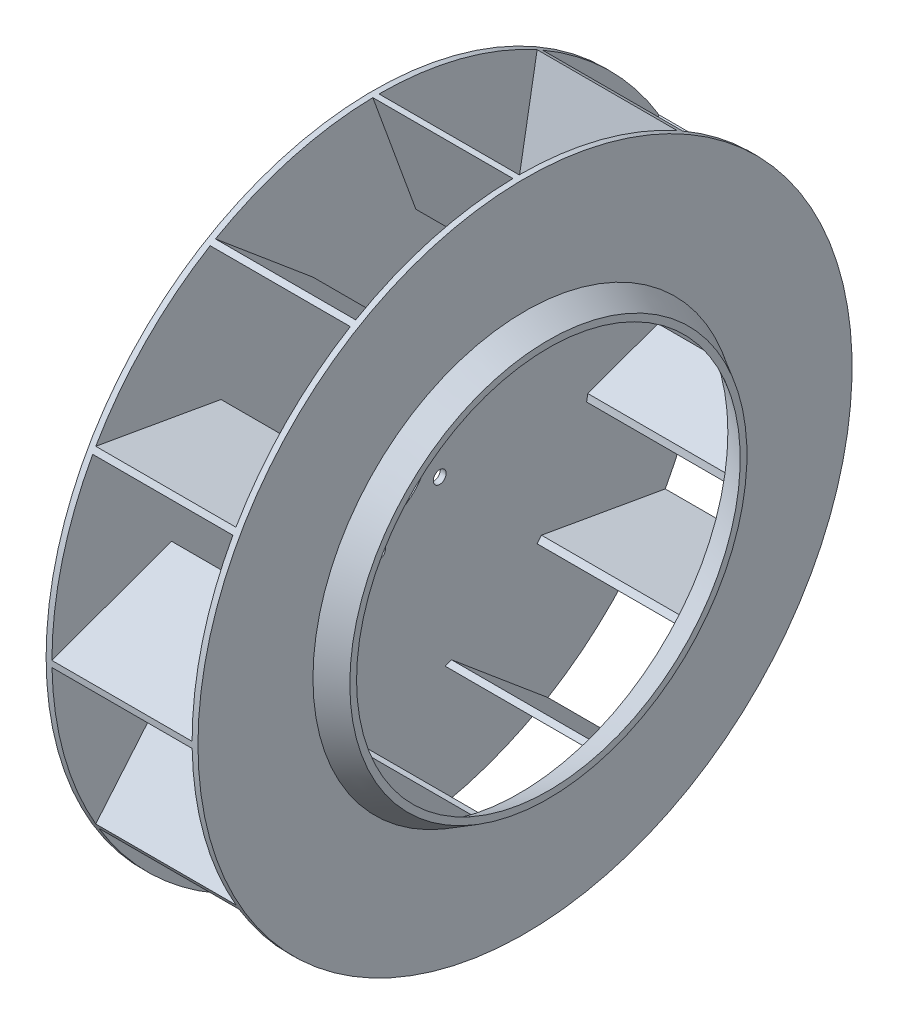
from build123d import *
from build123d.topology import SkipClean

# Parameters (mm, degrees)
SHELL_2_T                = -5
CUT_EXTRUDE_2_DEPTH      = 404.019850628
CUT_EXTRUDE_2_DEPTH_BACK = 404.019850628
SKETCH_4_W               = 120
SKETCH_4_H               = 601.043370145
EXTRUDE_3_DEPTH          = 120
PATTERN_CIRCULAR_3_COUNT = 12
SKETCH_7_R               = 42.5
CUT_EXTRUDE_4_DEPTH      = 422.693016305
HOLE_WIZARD_1_D          = 11
PATTERN_CIRCULAR_4_COUNT = 6


with BuildPart() as part:
    # Sketch 3 → Revolve 1 (revolve)
    with BuildSketch(Plane.XY, mode=Mode.PRIVATE) as revolve_1_sk:
        Polygon((55, 181.547005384), (75, 170), (75, 0), (-75, 0), (-75, 280), (55, 280), align=None)
    revolve(revolve_1_sk.sketch.rotate(Axis((-75, 0, 0), (1, 0, 0)), 90), axis=Axis((-75, 0, 0), (1, 0, 0)))

    # Shell 2
    shell_2_openings = [part.faces().sort_by_distance(p)[0] for p in [
        (75, 0, 0),
    ]]
    offset(amount=SHELL_2_T, openings=shell_2_openings, kind=Kind.INTERSECTION)

    # Sketch 4 → Cut-Extrude 2 (cut, two sides: drawn at the far end of the back side and taken through both)
    with BuildSketch(Plane.XY.offset(-CUT_EXTRUDE_2_DEPTH_BACK)):
        with Locations((-10, -12.861127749)):
            Rectangle(SKETCH_4_W, SKETCH_4_H)
    extrude(amount=CUT_EXTRUDE_2_DEPTH + CUT_EXTRUDE_2_DEPTH_BACK, mode=Mode.SUBTRACT)


with BuildPart() as cut_extrude_2_piece_1:
    # of the separate pieces the step leaves, piece 1, a body of its own (cut_extrude_2_pieces)
    add(part.part.solids().sort_by_distance((-75, 0, 280))[0])



with BuildPart() as cut_extrude_2_piece_2:
    # of the separate pieces the step leaves, piece 2, a body of its own (cut_extrude_2_pieces)
    add(part.part.solids().sort_by_distance((50, 0, 280))[0])


with BuildPart() as cut_extrude_2_piece_1_1:
    add(cut_extrude_2_piece_1.part)

    add(cut_extrude_2_piece_2.part)  # Extrude 3 merges Cut-Extrude 2 piece 2
    # Sketch 5 → Extrude 3 (add)
    with BuildSketch(Plane(origin=(-70, 0, 0), x_dir=(0, 0, -1), z_dir=(1, 0, 0))):
        with BuildLine():
            Line((0, 280), (37.23898579, 177.68672742))
            ThreePointArc((37.23898579, 177.68672742), (34.382105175, 178.261566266), (31.516365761, 178.790474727))
            Line((31.516365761, 178.790474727), (-5.302612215, 279.949785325))
            ThreePointArc((-5.302612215, 279.949785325), (-2.651424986, 279.98744605), (0, 280))
        make_face()
    extrude_3 = extrude(amount=EXTRUDE_3_DEPTH)

    # Pattern Circular 3: Extrude 3 ×12 about axis
    with SkipClean():  # the faces are left unmerged after this step: merging them gives an invalid solid
        pattern_circular_3_axis = Axis((0, 0, 0), (1, 0, 0))
        for i in range(1, PATTERN_CIRCULAR_3_COUNT):
            add(extrude_3.rotate(pattern_circular_3_axis, i * 360 / PATTERN_CIRCULAR_3_COUNT))

    # Sketch 7 → Cut-Extrude 4 (cut, through all)
    with SkipClean():  # the faces are left unmerged after this step: merging them gives an invalid solid
        with BuildSketch(Plane(origin=(-70, 0, 0), x_dir=(0, 0, -1), z_dir=(1, 0, 0))):
            Circle(SKETCH_7_R)
        extrude(amount=-CUT_EXTRUDE_4_DEPTH, mode=Mode.SUBTRACT)

    # Hole Wizard 1 (through all)
    with Locations(Plane(origin=(-70, 0, 0), x_dir=(0, 0, -1), z_dir=(1, 0, 0))):
        with Locations((0, 60)):
            hole_wizard_1 = Hole(HOLE_WIZARD_1_D / 2)

    # Pattern Circular 4: Hole Wizard 1 ×6 about axis
    with SkipClean():  # the faces are left unmerged after this step: merging them gives an invalid solid
        pattern_circular_4_axis = Axis((0, 0, 0), (1, 0, 0))
        for i in range(1, PATTERN_CIRCULAR_4_COUNT):
            add(hole_wizard_1.rotate(pattern_circular_4_axis, i * 360 / PATTERN_CIRCULAR_4_COUNT), mode=Mode.SUBTRACT)


solid = cut_extrude_2_piece_1_1.part
